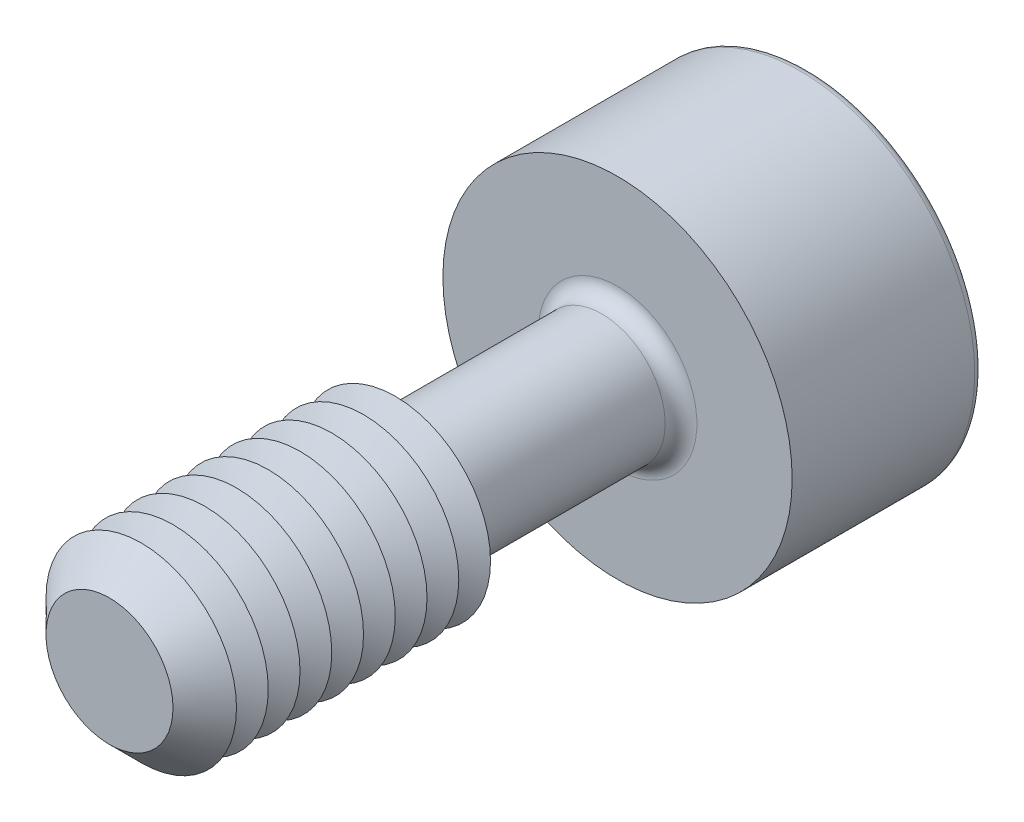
from build123d import *

# Parameters (mm, degrees)
SKETCH1_R       = 1
EXTRUDE1_DEPTH  = 4
CHAMFER1_SIZE   = 0.5
SKETCH3_R       = 2.75
EXTRUDE2_DEPTH  = 3
EXTRUDE3_DEPTH  = 2.5
FILLET1_R       = 0.25
FILLET2_R       = 0.125
LPATTERN1_COUNT = 8
LPATTERN1_PITCH = 0.5


with BuildPart() as part:
    # Sketch1 → Extrude1 (new, symmetric)
    with BuildSketch(Plane.XY):
        Circle(SKETCH1_R)
    extrude(amount=EXTRUDE1_DEPTH, both=True)

    # Sketch2 → Revolve1 (revolve)
    with BuildSketch(Plane(origin=(0, 0, 0), x_dir=(0, 0, -1), z_dir=(1, 0, 0))):
        Polygon((-4, 0), (-4, 1.5), (0.5, 1.5), (0.788675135, 1), (0.788675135, 0), align=None)
    revolve(axis=Axis((0, 0, -0.788675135), (0, 0, 1)))

    # Chamfer1
    chamfer1_edges = [part.edges().sort_by_distance(p)[0] for p in [
        (0, -1.5, 4),
    ]]
    chamfer(chamfer1_edges, length=CHAMFER1_SIZE)

    # Sketch3 → Extrude2 (add)
    with BuildSketch(Plane(origin=(0, 0, -4), x_dir=(-1, 0, 0), z_dir=(0, 0, -1))):
        Circle(SKETCH3_R)
    extrude(amount=EXTRUDE2_DEPTH)

    # Sketch4 → Extrude3 (cut)
    with BuildSketch(Plane(origin=(-13.7, 0, -7), x_dir=(1, 0, 0), z_dir=(0, 0, 1))):
        Polygon((12.978312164, -1.25), (14.421687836, -1.25), (15.143375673, 0), (14.421687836, 1.25), (12.978312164, 1.25), (12.256624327, 0), align=None)
    extrude(amount=EXTRUDE3_DEPTH, mode=Mode.SUBTRACT)

    # Fillet1
    fillet1_edges = [part.edges().sort_by_distance(p)[0] for p in [
        (-1, 0, -4),
    ]]
    fillet(fillet1_edges, radius=FILLET1_R)

    # Fillet2
    fillet2_edges = [part.edges().sort_by_distance(p)[0] for p in [
        (2.75, 0, -7),
    ]]
    fillet(fillet2_edges, radius=FILLET2_R)

    # Sketch5 → Cut-Revolve1 (revolve, cut)
    with BuildSketch(Plane(origin=(0, 0, 0), x_dir=(0, 0, -1), z_dir=(1, 0, 0)), mode=Mode.PRIVATE) as cut_revolve1_sk:
        Polygon((4.5, 0), (4.5, -1.25), (3.778312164, 0), align=None)
    revolve(cut_revolve1_sk.sketch.rotate(Axis((0, 0, -3.778312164), (0, 0, -1)), 90), axis=Axis((0, 0, -3.778312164), (0, 0, -1)), mode=Mode.SUBTRACT)

    # Sketch7 → Cut-Revolve2 (revolve, cut)
    with BuildSketch(Plane(origin=(0, 0, 0), x_dir=(0, 0, -1), z_dir=(1, 0, 0)), mode=Mode.PRIVATE) as cut_revolve2_sk:
        Polygon((0.5, 1.5), (0.25, 1.066987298), (0, 1.5), align=None)
    cut_revolve2 = revolve(cut_revolve2_sk.sketch.rotate(Axis((0, 0, -1.332048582), (0, 0, 1)), 90), axis=Axis((0, 0, -1.332048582), (0, 0, 1)), mode=Mode.SUBTRACT)

    # LPattern1: Cut-Revolve2 ×8
    with Locations(*[(0, 0, i * LPATTERN1_PITCH) for i in range(1, LPATTERN1_COUNT)]):
        add(cut_revolve2, mode=Mode.SUBTRACT)


solid = part.part
